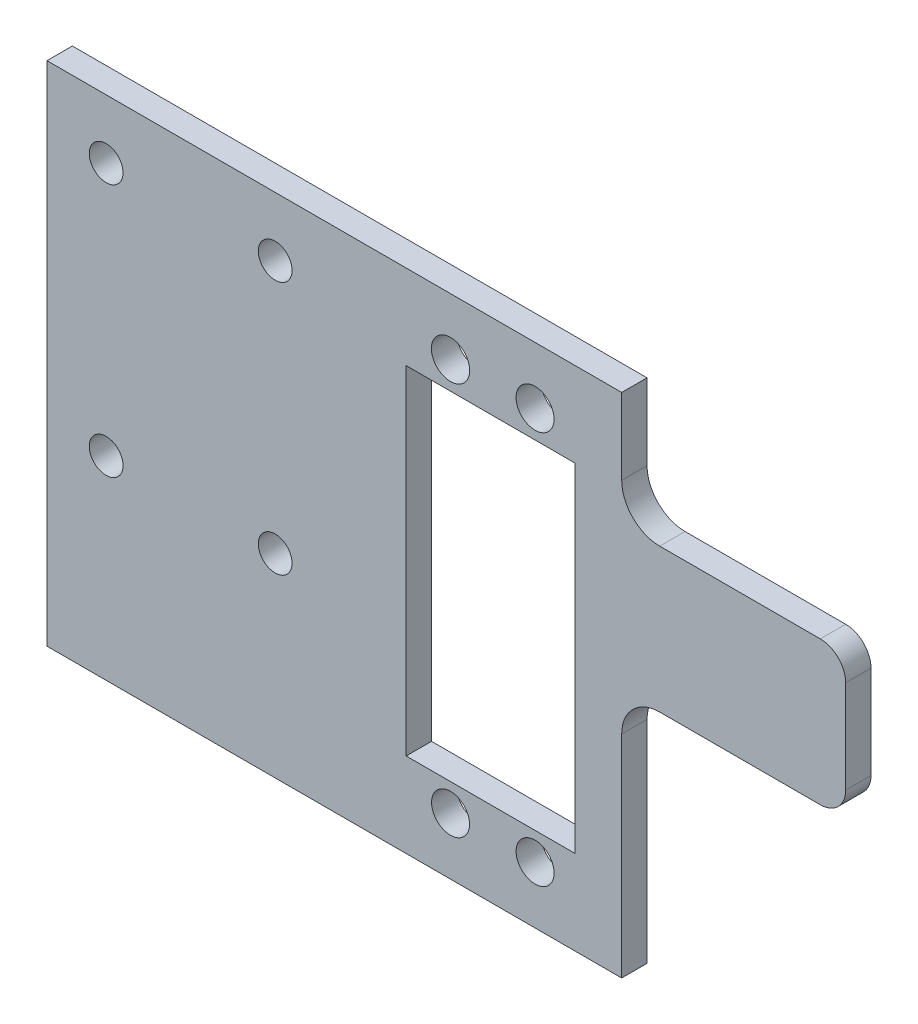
from build123d import *

# Parameters (mm, degrees)
SKETCH2_R           = 2
SKETCH2_R_2         = 2.25
SKETCH2_R_3         = 2.263846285
BOSS_EXTRUDE1_DEPTH = 3


with BuildPart() as part:
    # Sketch2 → Boss-Extrude1 (new body)
    with BuildSketch(Plane.XY):
        with BuildLine():
            Line((-85.938864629, 45.720524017), (-20.938864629, 45.720524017))
            Line((-20.938864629, 45.720524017), (-17.938864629, 45.720524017))
            Line((-17.938864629, 45.720524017), (-17.938864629, 36.720524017))
            ThreePointArc((-17.938864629, 36.720524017), (-16.620845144, 33.538543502), (-13.438864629, 32.220524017))
            Line((-13.438864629, 32.220524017), (5.561135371, 32.220524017))
            ThreePointArc((5.561135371, 32.220524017), (7.682455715, 31.341844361), (8.561135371, 29.220524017))
            Line((8.561135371, 29.220524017), (8.561135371, 23.720524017))
            Line((8.561135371, 23.720524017), (8.561135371, 18.220524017))
            ThreePointArc((8.561135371, 18.220524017), (7.682455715, 16.099203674), (5.561135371, 15.220524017))
            Line((5.561135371, 15.220524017), (-13.438864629, 15.220524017))
            ThreePointArc((-13.438864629, 15.220524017), (-16.620845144, 13.902504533), (-17.938864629, 10.720524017))
            Line((-17.938864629, 10.720524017), (-17.938864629, -14.279475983))
            Line((-17.938864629, -14.279475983), (-20.938864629, -14.279475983))
            Line((-20.938864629, -14.279475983), (-85.938864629, -14.279475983))
            Line((-85.938864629, -14.279475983), (-85.938864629, 45.720524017))
        make_face()
        with Locations((-78.938864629, 38.720524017)):
            Circle(SKETCH2_R, mode=Mode.SUBTRACT)
        with Locations((-78.938864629, 8.720524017)):
            Circle(SKETCH2_R, mode=Mode.SUBTRACT)
        with Locations((-58.938864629, 38.720524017)):
            Circle(SKETCH2_R, mode=Mode.SUBTRACT)
        with Locations((-58.938864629, 8.720524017)):
            Circle(SKETCH2_R, mode=Mode.SUBTRACT)
        with Locations((-28.188864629, 38.970524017)):
            Circle(SKETCH2_R_2, mode=Mode.SUBTRACT)
        with Locations((-38.188864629, 38.970524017)):
            Circle(SKETCH2_R_3, mode=Mode.SUBTRACT)
        with Locations((-28.188864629, -7.529475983)):
            Circle(SKETCH2_R_2, mode=Mode.SUBTRACT)
        with Locations((-38.188864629, -7.529475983)):
            Circle(SKETCH2_R_2, mode=Mode.SUBTRACT)
        Polygon((-33.438864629, 35.720524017), (-23.438864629, 35.720524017), (-23.438864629, -4.279475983), (-43.438864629, -4.279475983), (-43.438864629, 35.720524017), align=None, mode=Mode.SUBTRACT)
    extrude(amount=BOSS_EXTRUDE1_DEPTH)


solid = part.part
